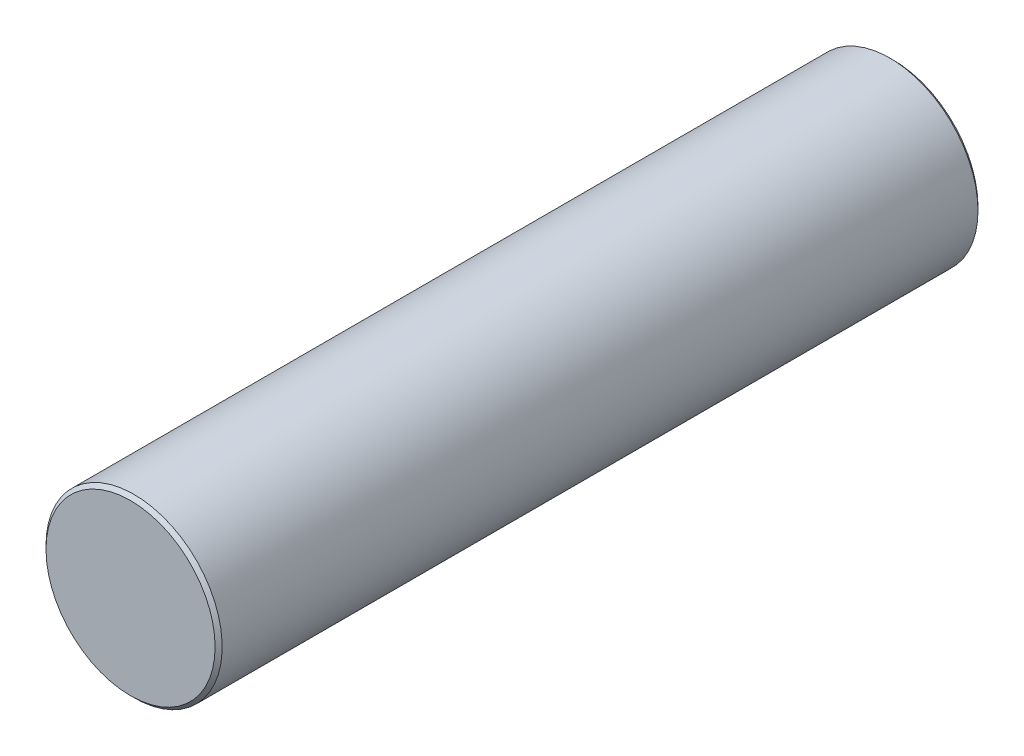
from build123d import *

# Parameters (mm, degrees)
SKETCH3_R           = 6.35
BOSS_EXTRUDE1_DEPTH = 54.999999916
CHAMFER1_SIZE       = 0.254


with BuildPart() as part:
    # Sketch3 → Boss-Extrude1 (new body)
    with BuildSketch(Plane.XY):
        with Locations(Location((0, 0, 0), (0, 0, 180))):
            Circle(SKETCH3_R)
    extrude(amount=BOSS_EXTRUDE1_DEPTH)

    # Chamfer1
    chamfer1_edges = [part.edges().sort_by_distance(p)[0] for p in [
        (6.35, 0, 0),
        (6.35, 0, 54.999999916),
    ]]
    chamfer(chamfer1_edges, length=CHAMFER1_SIZE)


solid = part.part
